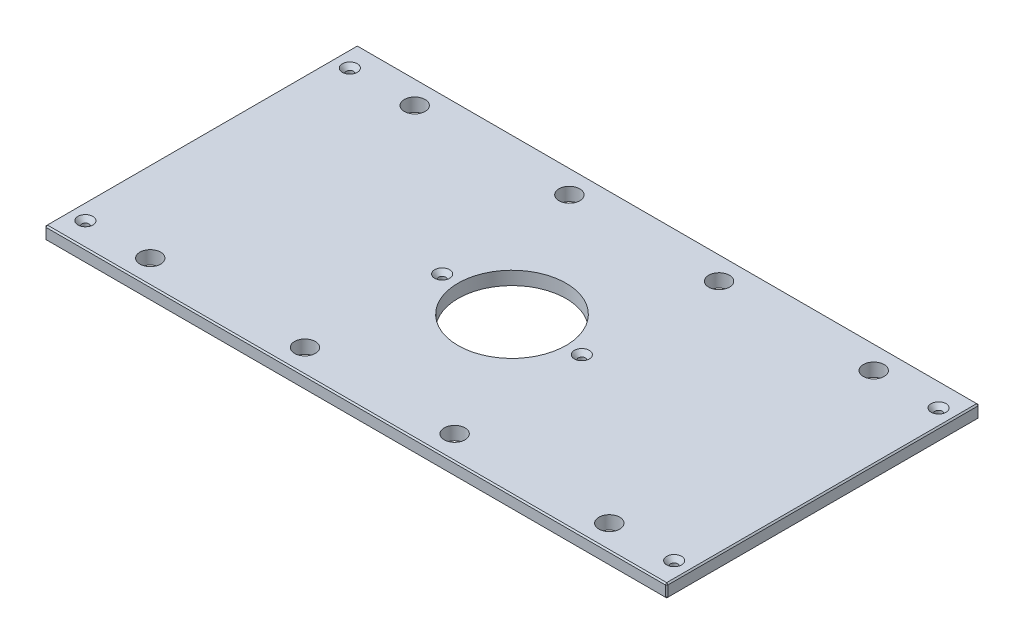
ISO-10303-21;
HEADER;
FILE_DESCRIPTION(('STEP AP214'),'2;1');
FILE_NAME('part.step','',(''),(''),'','','');
FILE_SCHEMA(('AUTOMOTIVE_DESIGN { 1 0 10303 214 1 1 1 1 }'));
ENDSEC;
DATA;
#1=APPLICATION_CONTEXT('core data for automotive mechanical design processes');
#2=APPLICATION_PROTOCOL_DEFINITION('international standard','automotive_design',2000,#1);
#3=PRODUCT_CONTEXT('',#1,'mechanical');
#4=PRODUCT('Part','Part','',(#3));
#5=PRODUCT_RELATED_PRODUCT_CATEGORY('part','',(#4));
#6=PRODUCT_DEFINITION_FORMATION('','',#4);
#7=PRODUCT_DEFINITION_CONTEXT('part definition',#1,'design');
#8=PRODUCT_DEFINITION('design','',#6,#7);
#9=PRODUCT_DEFINITION_SHAPE('','',#8);
#10=(LENGTH_UNIT() NAMED_UNIT(*) SI_UNIT(.MILLI.,.METRE.));
#11=(NAMED_UNIT(*) PLANE_ANGLE_UNIT() SI_UNIT($,.RADIAN.));
#12=(NAMED_UNIT(*) SI_UNIT($,.STERADIAN.) SOLID_ANGLE_UNIT());
#13=UNCERTAINTY_MEASURE_WITH_UNIT(LENGTH_MEASURE(1.E-05),#10,'distance_accuracy_value','');
#14=(GEOMETRIC_REPRESENTATION_CONTEXT(3) GLOBAL_UNCERTAINTY_ASSIGNED_CONTEXT((#13)) GLOBAL_UNIT_ASSIGNED_CONTEXT((#10,
#11,#12)) REPRESENTATION_CONTEXT('',''));
#15=CARTESIAN_POINT('',(0.,0.,0.));
#16=DIRECTION('',(0.,0.,1.));
#17=DIRECTION('',(1.,0.,0.));
#18=AXIS2_PLACEMENT_3D('',#15,#16,#17);
#19=CARTESIAN_POINT('',(-296.8625,12.7,-149.225));
#20=DIRECTION('',(1.,0.,0.));
#21=DIRECTION('',(0.,0.,-1.));
#22=AXIS2_PLACEMENT_3D('',#19,#20,#21);
#23=PLANE('',#22);
#24=DIRECTION('',(0.,0.,-1.));
#25=VECTOR('',#24,1.);
#26=CARTESIAN_POINT('',(-296.8625,11.43,-149.225));
#27=LINE('',#26,#25);
#28=CARTESIAN_POINT('',(-296.8625,11.43,147.955));
#29=VERTEX_POINT('',#28);
#30=CARTESIAN_POINT('',(-296.8625,11.43,-147.955));
#31=VERTEX_POINT('',#30);
#32=EDGE_CURVE('E135',#29,#31,#27,.T.);
#33=ORIENTED_EDGE('',*,*,#32,.T.);
#34=DIRECTION('',(0.,-1.,0.));
#35=VECTOR('',#34,1.);
#36=CARTESIAN_POINT('',(-296.8625,12.7,-147.955));
#37=LINE('',#36,#35);
#38=CARTESIAN_POINT('',(-296.8625,1.26999999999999,-147.955));
#39=VERTEX_POINT('',#38);
#40=EDGE_CURVE('E131',#31,#39,#37,.T.);
#41=ORIENTED_EDGE('',*,*,#40,.T.);
#42=DIRECTION('',(0.,0.,1.));
#43=VECTOR('',#42,1.);
#44=CARTESIAN_POINT('',(-296.8625,1.26999999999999,-149.225));
#45=LINE('',#44,#43);
#46=CARTESIAN_POINT('',(-296.8625,1.26999999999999,147.955));
#47=VERTEX_POINT('',#46);
#48=EDGE_CURVE('E126',#39,#47,#45,.T.);
#49=ORIENTED_EDGE('',*,*,#48,.T.);
#50=DIRECTION('',(0.,1.,0.));
#51=VECTOR('',#50,1.);
#52=CARTESIAN_POINT('',(-296.8625,12.7,147.955));
#53=LINE('',#52,#51);
#54=EDGE_CURVE('E128',#47,#29,#53,.T.);
#55=ORIENTED_EDGE('',*,*,#54,.T.);
#56=EDGE_LOOP('',(#33,#41,#49,#55));
#57=FACE_BOUND('',#56,.T.);
#58=ADVANCED_FACE('F35',(#57),#23,.F.);
#59=CARTESIAN_POINT('',(-296.8625,12.7,149.225));
#60=DIRECTION('',(0.,0.,-1.));
#61=DIRECTION('',(-1.,0.,0.));
#62=AXIS2_PLACEMENT_3D('',#59,#60,#61);
#63=PLANE('',#62);
#64=DIRECTION('',(1.,0.,0.));
#65=VECTOR('',#64,1.);
#66=CARTESIAN_POINT('',(-296.8625,1.27000000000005,149.225));
#67=LINE('',#66,#65);
#68=CARTESIAN_POINT('',(-295.5925,1.27000000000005,149.225));
#69=VERTEX_POINT('',#68);
#70=CARTESIAN_POINT('',(295.5925,1.27000000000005,149.225));
#71=VERTEX_POINT('',#70);
#72=EDGE_CURVE('E58',#69,#71,#67,.T.);
#73=ORIENTED_EDGE('',*,*,#72,.T.);
#74=DIRECTION('',(0.,1.,0.));
#75=VECTOR('',#74,1.);
#76=CARTESIAN_POINT('',(295.5925,12.7,149.225));
#77=LINE('',#76,#75);
#78=CARTESIAN_POINT('',(295.5925,11.4299999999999,149.225));
#79=VERTEX_POINT('',#78);
#80=EDGE_CURVE('E11',#71,#79,#77,.T.);
#81=ORIENTED_EDGE('',*,*,#80,.T.);
#82=DIRECTION('',(-1.,0.,0.));
#83=VECTOR('',#82,1.);
#84=CARTESIAN_POINT('',(-296.8625,11.4299999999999,149.225));
#85=LINE('',#84,#83);
#86=CARTESIAN_POINT('',(-295.5925,11.4299999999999,149.225));
#87=VERTEX_POINT('',#86);
#88=EDGE_CURVE('E44',#79,#87,#85,.T.);
#89=ORIENTED_EDGE('',*,*,#88,.T.);
#90=DIRECTION('',(0.,-1.,0.));
#91=VECTOR('',#90,1.);
#92=CARTESIAN_POINT('',(-295.5925,12.7,149.225));
#93=LINE('',#92,#91);
#94=EDGE_CURVE('E303',#87,#69,#93,.T.);
#95=ORIENTED_EDGE('',*,*,#94,.T.);
#96=EDGE_LOOP('',(#73,#81,#89,#95));
#97=FACE_BOUND('',#96,.T.);
#98=ADVANCED_FACE('F372',(#97),#63,.F.);
#99=CARTESIAN_POINT('',(296.8625,12.7,-149.225));
#100=DIRECTION('',(-1.,0.,0.));
#101=DIRECTION('',(0.,0.,1.));
#102=AXIS2_PLACEMENT_3D('',#99,#100,#101);
#103=PLANE('',#102);
#104=DIRECTION('',(0.,0.,-1.));
#105=VECTOR('',#104,1.);
#106=CARTESIAN_POINT('',(296.8625,1.27000000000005,-149.225));
#107=LINE('',#106,#105);
#108=CARTESIAN_POINT('',(296.8625,1.27000000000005,147.955));
#109=VERTEX_POINT('',#108);
#110=CARTESIAN_POINT('',(296.8625,1.27000000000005,-147.955));
#111=VERTEX_POINT('',#110);
#112=EDGE_CURVE('E298',#109,#111,#107,.T.);
#113=ORIENTED_EDGE('',*,*,#112,.T.);
#114=DIRECTION('',(0.,1.,0.));
#115=VECTOR('',#114,1.);
#116=CARTESIAN_POINT('',(296.8625,12.7,-147.955));
#117=LINE('',#116,#115);
#118=CARTESIAN_POINT('',(296.8625,11.43,-147.955));
#119=VERTEX_POINT('',#118);
#120=EDGE_CURVE('E300',#111,#119,#117,.T.);
#121=ORIENTED_EDGE('',*,*,#120,.T.);
#122=DIRECTION('',(0.,0.,1.));
#123=VECTOR('',#122,1.);
#124=CARTESIAN_POINT('',(296.8625,11.43,149.225));
#125=LINE('',#124,#123);
#126=CARTESIAN_POINT('',(296.8625,11.43,147.955));
#127=VERTEX_POINT('',#126);
#128=EDGE_CURVE('E296',#119,#127,#125,.T.);
#129=ORIENTED_EDGE('',*,*,#128,.T.);
#130=DIRECTION('',(0.,-1.,0.));
#131=VECTOR('',#130,1.);
#132=CARTESIAN_POINT('',(296.8625,12.7,147.955));
#133=LINE('',#132,#131);
#134=EDGE_CURVE('E294',#127,#109,#133,.T.);
#135=ORIENTED_EDGE('',*,*,#134,.T.);
#136=EDGE_LOOP('',(#113,#121,#129,#135));
#137=FACE_BOUND('',#136,.T.);
#138=ADVANCED_FACE('F359',(#137),#103,.F.);
#139=CARTESIAN_POINT('',(-296.8625,12.7,-149.225));
#140=DIRECTION('',(0.,0.,1.));
#141=DIRECTION('',(1.,0.,0.));
#142=AXIS2_PLACEMENT_3D('',#139,#140,#141);
#143=PLANE('',#142);
#144=DIRECTION('',(-1.,0.,0.));
#145=VECTOR('',#144,1.);
#146=CARTESIAN_POINT('',(-296.8625,1.27000000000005,-149.225));
#147=LINE('',#146,#145);
#148=CARTESIAN_POINT('',(295.5925,1.27000000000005,-149.225));
#149=VERTEX_POINT('',#148);
#150=CARTESIAN_POINT('',(-295.5925,1.27000000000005,-149.225));
#151=VERTEX_POINT('',#150);
#152=EDGE_CURVE('E270',#149,#151,#147,.T.);
#153=ORIENTED_EDGE('',*,*,#152,.T.);
#154=DIRECTION('',(0.,1.,0.));
#155=VECTOR('',#154,1.);
#156=CARTESIAN_POINT('',(-295.5925,12.7,-149.225));
#157=LINE('',#156,#155);
#158=CARTESIAN_POINT('',(-295.5925,11.43,-149.225));
#159=VERTEX_POINT('',#158);
#160=EDGE_CURVE('E274',#151,#159,#157,.T.);
#161=ORIENTED_EDGE('',*,*,#160,.T.);
#162=DIRECTION('',(1.,0.,0.));
#163=VECTOR('',#162,1.);
#164=CARTESIAN_POINT('',(296.8625,11.43,-149.225));
#165=LINE('',#164,#163);
#166=CARTESIAN_POINT('',(295.5925,11.43,-149.225));
#167=VERTEX_POINT('',#166);
#168=EDGE_CURVE('E272',#159,#167,#165,.T.);
#169=ORIENTED_EDGE('',*,*,#168,.T.);
#170=DIRECTION('',(0.,-1.,0.));
#171=VECTOR('',#170,1.);
#172=CARTESIAN_POINT('',(295.5925,12.7,-149.225));
#173=LINE('',#172,#171);
#174=EDGE_CURVE('E268',#167,#149,#173,.T.);
#175=ORIENTED_EDGE('',*,*,#174,.T.);
#176=EDGE_LOOP('',(#153,#161,#169,#175));
#177=FACE_BOUND('',#176,.T.);
#178=ADVANCED_FACE('F333',(#177),#143,.F.);
#179=CARTESIAN_POINT('',(0.,12.7,0.));
#180=DIRECTION('',(0.,1.,0.));
#181=DIRECTION('',(0.,0.,1.));
#182=AXIS2_PLACEMENT_3D('',#179,#180,#181);
#183=PLANE('',#182);
#184=CARTESIAN_POINT('',(280.9875,12.7,-126.20498));
#185=DIRECTION('',(0.,1.,0.));
#186=DIRECTION('',(0.,0.,1.));
#187=AXIS2_PLACEMENT_3D('',#184,#185,#186);
#188=CIRCLE('',#187,7.13740000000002);
#189=CARTESIAN_POINT('',(280.9875,12.7,-119.06758));
#190=VERTEX_POINT('',#189);
#191=EDGE_CURVE('E816',#190,#190,#188,.T.);
#192=ORIENTED_EDGE('',*,*,#191,.F.);
#193=EDGE_LOOP('',(#192));
#194=FACE_BOUND('',#193,.T.);
#195=CARTESIAN_POINT('',(280.9875,12.7,126.20498));
#196=DIRECTION('',(0.,1.,0.));
#197=DIRECTION('',(0.,0.,1.));
#198=AXIS2_PLACEMENT_3D('',#195,#196,#197);
#199=CIRCLE('',#198,7.13740000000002);
#200=CARTESIAN_POINT('',(280.9875,12.7,133.34238));
#201=VERTEX_POINT('',#200);
#202=EDGE_CURVE('E820',#201,#201,#199,.T.);
#203=ORIENTED_EDGE('',*,*,#202,.F.);
#204=EDGE_LOOP('',(#203));
#205=FACE_BOUND('',#204,.T.);
#206=CARTESIAN_POINT('',(-280.9875,12.7,126.20498));
#207=DIRECTION('',(0.,1.,0.));
#208=DIRECTION('',(0.,0.,1.));
#209=AXIS2_PLACEMENT_3D('',#206,#207,#208);
#210=CIRCLE('',#209,7.13740000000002);
#211=CARTESIAN_POINT('',(-280.9875,12.7,133.34238));
#212=VERTEX_POINT('',#211);
#213=EDGE_CURVE('E824',#212,#212,#210,.T.);
#214=ORIENTED_EDGE('',*,*,#213,.F.);
#215=EDGE_LOOP('',(#214));
#216=FACE_BOUND('',#215,.T.);
#217=CARTESIAN_POINT('',(-66.675,12.7,0.));
#218=DIRECTION('',(0.,1.,0.));
#219=DIRECTION('',(0.,0.,1.));
#220=AXIS2_PLACEMENT_3D('',#217,#218,#219);
#221=CIRCLE('',#220,7.1374);
#222=CARTESIAN_POINT('',(-66.675,12.7,7.1374));
#223=VERTEX_POINT('',#222);
#224=EDGE_CURVE('E828',#223,#223,#221,.T.);
#225=ORIENTED_EDGE('',*,*,#224,.F.);
#226=EDGE_LOOP('',(#225));
#227=FACE_BOUND('',#226,.T.);
#228=CARTESIAN_POINT('',(66.675,12.7,0.));
#229=DIRECTION('',(0.,1.,0.));
#230=DIRECTION('',(0.,0.,1.));
#231=AXIS2_PLACEMENT_3D('',#228,#229,#230);
#232=CIRCLE('',#231,7.1374);
#233=CARTESIAN_POINT('',(66.675,12.7,7.1374));
#234=VERTEX_POINT('',#233);
#235=EDGE_CURVE('E832',#234,#234,#232,.T.);
#236=ORIENTED_EDGE('',*,*,#235,.F.);
#237=EDGE_LOOP('',(#236));
#238=FACE_BOUND('',#237,.T.);
#239=CARTESIAN_POINT('',(-280.9875,12.7,-126.20498));
#240=DIRECTION('',(0.,1.,0.));
#241=DIRECTION('',(0.,0.,1.));
#242=AXIS2_PLACEMENT_3D('',#239,#240,#241);
#243=CIRCLE('',#242,7.13740000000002);
#244=CARTESIAN_POINT('',(-280.9875,12.7,-119.06758));
#245=VERTEX_POINT('',#244);
#246=EDGE_CURVE('E835',#245,#245,#243,.T.);
#247=ORIENTED_EDGE('',*,*,#246,.F.);
#248=EDGE_LOOP('',(#247));
#249=FACE_BOUND('',#248,.T.);
#250=DIRECTION('',(0.,0.,-1.));
#251=VECTOR('',#250,1.);
#252=CARTESIAN_POINT('',(295.5925,12.7,-149.225));
#253=LINE('',#252,#251);
#254=CARTESIAN_POINT('',(295.5925,12.7,147.955));
#255=VERTEX_POINT('',#254);
#256=CARTESIAN_POINT('',(295.5925,12.7,-147.955));
#257=VERTEX_POINT('',#256);
#258=EDGE_CURVE('E281',#255,#257,#253,.T.);
#259=ORIENTED_EDGE('',*,*,#258,.T.);
#260=DIRECTION('',(-1.,0.,0.));
#261=VECTOR('',#260,1.);
#262=CARTESIAN_POINT('',(-296.8625,12.7,-147.955));
#263=LINE('',#262,#261);
#264=CARTESIAN_POINT('',(-295.5925,12.7,-147.955));
#265=VERTEX_POINT('',#264);
#266=EDGE_CURVE('E283',#257,#265,#263,.T.);
#267=ORIENTED_EDGE('',*,*,#266,.T.);
#268=DIRECTION('',(0.,0.,1.));
#269=VECTOR('',#268,1.);
#270=CARTESIAN_POINT('',(-295.5925,12.7,149.225));
#271=LINE('',#270,#269);
#272=CARTESIAN_POINT('',(-295.5925,12.7,147.955));
#273=VERTEX_POINT('',#272);
#274=EDGE_CURVE('E279',#265,#273,#271,.T.);
#275=ORIENTED_EDGE('',*,*,#274,.T.);
#276=DIRECTION('',(1.,0.,0.));
#277=VECTOR('',#276,1.);
#278=CARTESIAN_POINT('',(296.8625,12.7,147.955));
#279=LINE('',#278,#277);
#280=EDGE_CURVE('E277',#273,#255,#279,.T.);
#281=ORIENTED_EDGE('',*,*,#280,.T.);
#282=EDGE_LOOP('',(#259,#267,#275,#281));
#283=FACE_BOUND('',#282,.T.);
#284=CARTESIAN_POINT('',(219.075,12.7,-126.20498));
#285=DIRECTION('',(0.,1.,0.));
#286=DIRECTION('',(0.,0.,1.));
#287=AXIS2_PLACEMENT_3D('',#284,#285,#286);
#288=CIRCLE('',#287,9.921875);
#289=CARTESIAN_POINT('',(219.075,12.7,-116.283105));
#290=VERTEX_POINT('',#289);
#291=EDGE_CURVE('E204',#290,#290,#288,.T.);
#292=ORIENTED_EDGE('',*,*,#291,.F.);
#293=EDGE_LOOP('',(#292));
#294=FACE_BOUND('',#293,.T.);
#295=CARTESIAN_POINT('',(-219.075,12.7,-126.20498));
#296=DIRECTION('',(0.,1.,0.));
#297=DIRECTION('',(0.,0.,1.));
#298=AXIS2_PLACEMENT_3D('',#295,#296,#297);
#299=CIRCLE('',#298,9.921875);
#300=CARTESIAN_POINT('',(-219.075,12.7,-116.283105));
#301=VERTEX_POINT('',#300);
#302=EDGE_CURVE('E214',#301,#301,#299,.T.);
#303=ORIENTED_EDGE('',*,*,#302,.F.);
#304=EDGE_LOOP('',(#303));
#305=FACE_BOUND('',#304,.T.);
#306=CARTESIAN_POINT('',(219.075,12.7,126.20498));
#307=DIRECTION('',(0.,1.,0.));
#308=DIRECTION('',(0.,0.,1.));
#309=AXIS2_PLACEMENT_3D('',#306,#307,#308);
#310=CIRCLE('',#309,9.921875);
#311=CARTESIAN_POINT('',(219.075,12.7,136.126855));
#312=VERTEX_POINT('',#311);
#313=EDGE_CURVE('E225',#312,#312,#310,.T.);
#314=ORIENTED_EDGE('',*,*,#313,.F.);
#315=EDGE_LOOP('',(#314));
#316=FACE_BOUND('',#315,.T.);
#317=CARTESIAN_POINT('',(-219.075,12.7,126.20498));
#318=DIRECTION('',(0.,1.,0.));
#319=DIRECTION('',(0.,0.,1.));
#320=AXIS2_PLACEMENT_3D('',#317,#318,#319);
#321=CIRCLE('',#320,9.921875);
#322=CARTESIAN_POINT('',(-219.075,12.7,136.126855));
#323=VERTEX_POINT('',#322);
#324=EDGE_CURVE('E231',#323,#323,#321,.T.);
#325=ORIENTED_EDGE('',*,*,#324,.F.);
#326=EDGE_LOOP('',(#325));
#327=FACE_BOUND('',#326,.T.);
#328=CARTESIAN_POINT('',(-71.4375,12.7,-126.20498));
#329=DIRECTION('',(0.,1.,0.));
#330=DIRECTION('',(0.,0.,1.));
#331=AXIS2_PLACEMENT_3D('',#328,#329,#330);
#332=CIRCLE('',#331,9.921875);
#333=CARTESIAN_POINT('',(-71.4375,12.7,-116.283105));
#334=VERTEX_POINT('',#333);
#335=EDGE_CURVE('E237',#334,#334,#332,.T.);
#336=ORIENTED_EDGE('',*,*,#335,.F.);
#337=EDGE_LOOP('',(#336));
#338=FACE_BOUND('',#337,.T.);
#339=CARTESIAN_POINT('',(71.4375,12.7,-126.20498));
#340=DIRECTION('',(0.,1.,0.));
#341=DIRECTION('',(0.,0.,1.));
#342=AXIS2_PLACEMENT_3D('',#339,#340,#341);
#343=CIRCLE('',#342,9.921875);
#344=CARTESIAN_POINT('',(71.4375,12.7,-116.283105));
#345=VERTEX_POINT('',#344);
#346=EDGE_CURVE('E243',#345,#345,#343,.T.);
#347=ORIENTED_EDGE('',*,*,#346,.F.);
#348=EDGE_LOOP('',(#347));
#349=FACE_BOUND('',#348,.T.);
#350=CARTESIAN_POINT('',(71.4375,12.7,126.20498));
#351=DIRECTION('',(0.,1.,0.));
#352=DIRECTION('',(0.,0.,1.));
#353=AXIS2_PLACEMENT_3D('',#350,#351,#352);
#354=CIRCLE('',#353,9.921875);
#355=CARTESIAN_POINT('',(71.4375,12.7,136.126855));
#356=VERTEX_POINT('',#355);
#357=EDGE_CURVE('E249',#356,#356,#354,.T.);
#358=ORIENTED_EDGE('',*,*,#357,.F.);
#359=EDGE_LOOP('',(#358));
#360=FACE_BOUND('',#359,.T.);
#361=CARTESIAN_POINT('',(-71.4375,12.7,126.20498));
#362=DIRECTION('',(0.,1.,0.));
#363=DIRECTION('',(0.,0.,1.));
#364=AXIS2_PLACEMENT_3D('',#361,#362,#363);
#365=CIRCLE('',#364,9.921875);
#366=CARTESIAN_POINT('',(-71.4375,12.7,136.126855));
#367=VERTEX_POINT('',#366);
#368=EDGE_CURVE('E255',#367,#367,#365,.T.);
#369=ORIENTED_EDGE('',*,*,#368,.F.);
#370=EDGE_LOOP('',(#369));
#371=FACE_BOUND('',#370,.T.);
#372=CARTESIAN_POINT('',(0.,12.7,0.));
#373=DIRECTION('',(0.,1.,0.));
#374=DIRECTION('',(0.,0.,1.));
#375=AXIS2_PLACEMENT_3D('',#372,#373,#374);
#376=CIRCLE('',#375,51.562);
#377=CARTESIAN_POINT('',(0.,12.7,51.562));
#378=VERTEX_POINT('',#377);
#379=EDGE_CURVE('E261',#378,#378,#376,.T.);
#380=ORIENTED_EDGE('',*,*,#379,.F.);
#381=EDGE_LOOP('',(#380));
#382=FACE_BOUND('',#381,.T.);
#383=ADVANCED_FACE('F381',(#194,#205,#216,#227,#238,#249,#283,#294,#305,#316,#327,#338,#349,
#360,#371,#382),#183,.T.);
#384=CARTESIAN_POINT('',(0.,0.,0.));
#385=DIRECTION('',(0.,1.,0.));
#386=DIRECTION('',(0.,0.,1.));
#387=AXIS2_PLACEMENT_3D('',#384,#385,#386);
#388=PLANE('',#387);
#389=CARTESIAN_POINT('',(280.9875,0.,-126.20498));
#390=DIRECTION('',(0.,1.,0.));
#391=DIRECTION('',(0.,0.,1.));
#392=AXIS2_PLACEMENT_3D('',#389,#390,#391);
#393=CIRCLE('',#392,3.3782);
#394=CARTESIAN_POINT('',(280.9875,0.,-122.82678));
#395=VERTEX_POINT('',#394);
#396=EDGE_CURVE('E869',#395,#395,#393,.T.);
#397=ORIENTED_EDGE('',*,*,#396,.T.);
#398=EDGE_LOOP('',(#397));
#399=FACE_BOUND('',#398,.T.);
#400=CARTESIAN_POINT('',(280.9875,0.,126.20498));
#401=DIRECTION('',(0.,1.,0.));
#402=DIRECTION('',(0.,0.,1.));
#403=AXIS2_PLACEMENT_3D('',#400,#401,#402);
#404=CIRCLE('',#403,3.3782);
#405=CARTESIAN_POINT('',(280.9875,0.,129.58318));
#406=VERTEX_POINT('',#405);
#407=EDGE_CURVE('E862',#406,#406,#404,.T.);
#408=ORIENTED_EDGE('',*,*,#407,.T.);
#409=EDGE_LOOP('',(#408));
#410=FACE_BOUND('',#409,.T.);
#411=CARTESIAN_POINT('',(-280.9875,0.,126.20498));
#412=DIRECTION('',(0.,1.,0.));
#413=DIRECTION('',(0.,0.,1.));
#414=AXIS2_PLACEMENT_3D('',#411,#412,#413);
#415=CIRCLE('',#414,3.3782);
#416=CARTESIAN_POINT('',(-280.9875,0.,129.58318));
#417=VERTEX_POINT('',#416);
#418=EDGE_CURVE('E855',#417,#417,#415,.T.);
#419=ORIENTED_EDGE('',*,*,#418,.T.);
#420=EDGE_LOOP('',(#419));
#421=FACE_BOUND('',#420,.T.);
#422=CARTESIAN_POINT('',(-66.675,0.,0.));
#423=DIRECTION('',(0.,1.,0.));
#424=DIRECTION('',(0.,0.,1.));
#425=AXIS2_PLACEMENT_3D('',#422,#423,#424);
#426=CIRCLE('',#425,3.3782);
#427=CARTESIAN_POINT('',(-66.675,0.,3.3782));
#428=VERTEX_POINT('',#427);
#429=EDGE_CURVE('E848',#428,#428,#426,.T.);
#430=ORIENTED_EDGE('',*,*,#429,.T.);
#431=EDGE_LOOP('',(#430));
#432=FACE_BOUND('',#431,.T.);
#433=CARTESIAN_POINT('',(66.675,0.,0.));
#434=DIRECTION('',(0.,1.,0.));
#435=DIRECTION('',(0.,0.,1.));
#436=AXIS2_PLACEMENT_3D('',#433,#434,#435);
#437=CIRCLE('',#436,3.3782);
#438=CARTESIAN_POINT('',(66.675,0.,3.3782));
#439=VERTEX_POINT('',#438);
#440=EDGE_CURVE('E838',#439,#439,#437,.T.);
#441=ORIENTED_EDGE('',*,*,#440,.T.);
#442=EDGE_LOOP('',(#441));
#443=FACE_BOUND('',#442,.T.);
#444=CARTESIAN_POINT('',(-280.9875,0.,-126.20498));
#445=DIRECTION('',(0.,1.,0.));
#446=DIRECTION('',(0.,0.,1.));
#447=AXIS2_PLACEMENT_3D('',#444,#445,#446);
#448=CIRCLE('',#447,3.3782);
#449=CARTESIAN_POINT('',(-280.9875,0.,-122.82678));
#450=VERTEX_POINT('',#449);
#451=EDGE_CURVE('E217',#450,#450,#448,.T.);
#452=ORIENTED_EDGE('',*,*,#451,.T.);
#453=EDGE_LOOP('',(#452));
#454=FACE_BOUND('',#453,.T.);
#455=DIRECTION('',(0.,0.,-1.));
#456=VECTOR('',#455,1.);
#457=CARTESIAN_POINT('',(-295.5925,0.,0.));
#458=LINE('',#457,#456);
#459=CARTESIAN_POINT('',(-295.5925,0.,147.955));
#460=VERTEX_POINT('',#459);
#461=CARTESIAN_POINT('',(-295.5925,0.,-147.955));
#462=VERTEX_POINT('',#461);
#463=EDGE_CURVE('E158',#460,#462,#458,.T.);
#464=ORIENTED_EDGE('',*,*,#463,.T.);
#465=DIRECTION('',(1.,0.,0.));
#466=VECTOR('',#465,1.);
#467=CARTESIAN_POINT('',(0.,0.,-147.955));
#468=LINE('',#467,#466);
#469=CARTESIAN_POINT('',(295.5925,0.,-147.955));
#470=VERTEX_POINT('',#469);
#471=EDGE_CURVE('E291',#462,#470,#468,.T.);
#472=ORIENTED_EDGE('',*,*,#471,.T.);
#473=DIRECTION('',(0.,0.,1.));
#474=VECTOR('',#473,1.);
#475=CARTESIAN_POINT('',(295.5925,0.,0.));
#476=LINE('',#475,#474);
#477=CARTESIAN_POINT('',(295.5925,0.,147.955));
#478=VERTEX_POINT('',#477);
#479=EDGE_CURVE('E289',#470,#478,#476,.T.);
#480=ORIENTED_EDGE('',*,*,#479,.T.);
#481=DIRECTION('',(-1.,0.,0.));
#482=VECTOR('',#481,1.);
#483=CARTESIAN_POINT('',(0.,0.,147.955));
#484=LINE('',#483,#482);
#485=EDGE_CURVE('E286',#478,#460,#484,.T.);
#486=ORIENTED_EDGE('',*,*,#485,.T.);
#487=EDGE_LOOP('',(#464,#472,#480,#486));
#488=FACE_BOUND('',#487,.T.);
#489=CARTESIAN_POINT('',(219.075,0.,-126.20498));
#490=DIRECTION('',(0.,1.,0.));
#491=DIRECTION('',(0.,0.,1.));
#492=AXIS2_PLACEMENT_3D('',#489,#490,#491);
#493=CIRCLE('',#492,9.921875);
#494=CARTESIAN_POINT('',(219.075,0.,-116.283105));
#495=VERTEX_POINT('',#494);
#496=EDGE_CURVE('E209',#495,#495,#493,.T.);
#497=ORIENTED_EDGE('',*,*,#496,.T.);
#498=EDGE_LOOP('',(#497));
#499=FACE_BOUND('',#498,.T.);
#500=CARTESIAN_POINT('',(-219.075,0.,-126.20498));
#501=DIRECTION('',(0.,1.,0.));
#502=DIRECTION('',(0.,0.,1.));
#503=AXIS2_PLACEMENT_3D('',#500,#501,#502);
#504=CIRCLE('',#503,9.921875);
#505=CARTESIAN_POINT('',(-219.075,0.,-116.283105));
#506=VERTEX_POINT('',#505);
#507=EDGE_CURVE('E222',#506,#506,#504,.T.);
#508=ORIENTED_EDGE('',*,*,#507,.T.);
#509=EDGE_LOOP('',(#508));
#510=FACE_BOUND('',#509,.T.);
#511=CARTESIAN_POINT('',(219.075,0.,126.20498));
#512=DIRECTION('',(0.,1.,0.));
#513=DIRECTION('',(0.,0.,1.));
#514=AXIS2_PLACEMENT_3D('',#511,#512,#513);
#515=CIRCLE('',#514,9.921875);
#516=CARTESIAN_POINT('',(219.075,0.,136.126855));
#517=VERTEX_POINT('',#516);
#518=EDGE_CURVE('E228',#517,#517,#515,.T.);
#519=ORIENTED_EDGE('',*,*,#518,.T.);
#520=EDGE_LOOP('',(#519));
#521=FACE_BOUND('',#520,.T.);
#522=CARTESIAN_POINT('',(-219.075,0.,126.20498));
#523=DIRECTION('',(0.,1.,0.));
#524=DIRECTION('',(0.,0.,1.));
#525=AXIS2_PLACEMENT_3D('',#522,#523,#524);
#526=CIRCLE('',#525,9.921875);
#527=CARTESIAN_POINT('',(-219.075,0.,136.126855));
#528=VERTEX_POINT('',#527);
#529=EDGE_CURVE('E234',#528,#528,#526,.T.);
#530=ORIENTED_EDGE('',*,*,#529,.T.);
#531=EDGE_LOOP('',(#530));
#532=FACE_BOUND('',#531,.T.);
#533=CARTESIAN_POINT('',(-71.4375,0.,-126.20498));
#534=DIRECTION('',(0.,1.,0.));
#535=DIRECTION('',(0.,0.,1.));
#536=AXIS2_PLACEMENT_3D('',#533,#534,#535);
#537=CIRCLE('',#536,9.921875);
#538=CARTESIAN_POINT('',(-71.4375,0.,-116.283105));
#539=VERTEX_POINT('',#538);
#540=EDGE_CURVE('E240',#539,#539,#537,.T.);
#541=ORIENTED_EDGE('',*,*,#540,.T.);
#542=EDGE_LOOP('',(#541));
#543=FACE_BOUND('',#542,.T.);
#544=CARTESIAN_POINT('',(71.4375,0.,-126.20498));
#545=DIRECTION('',(0.,1.,0.));
#546=DIRECTION('',(0.,0.,1.));
#547=AXIS2_PLACEMENT_3D('',#544,#545,#546);
#548=CIRCLE('',#547,9.921875);
#549=CARTESIAN_POINT('',(71.4375,0.,-116.283105));
#550=VERTEX_POINT('',#549);
#551=EDGE_CURVE('E246',#550,#550,#548,.T.);
#552=ORIENTED_EDGE('',*,*,#551,.T.);
#553=EDGE_LOOP('',(#552));
#554=FACE_BOUND('',#553,.T.);
#555=CARTESIAN_POINT('',(71.4375,0.,126.20498));
#556=DIRECTION('',(0.,1.,0.));
#557=DIRECTION('',(0.,0.,1.));
#558=AXIS2_PLACEMENT_3D('',#555,#556,#557);
#559=CIRCLE('',#558,9.921875);
#560=CARTESIAN_POINT('',(71.4375,0.,136.126855));
#561=VERTEX_POINT('',#560);
#562=EDGE_CURVE('E252',#561,#561,#559,.T.);
#563=ORIENTED_EDGE('',*,*,#562,.T.);
#564=EDGE_LOOP('',(#563));
#565=FACE_BOUND('',#564,.T.);
#566=CARTESIAN_POINT('',(-71.4375,0.,126.20498));
#567=DIRECTION('',(0.,1.,0.));
#568=DIRECTION('',(0.,0.,1.));
#569=AXIS2_PLACEMENT_3D('',#566,#567,#568);
#570=CIRCLE('',#569,9.921875);
#571=CARTESIAN_POINT('',(-71.4375,0.,136.126855));
#572=VERTEX_POINT('',#571);
#573=EDGE_CURVE('E258',#572,#572,#570,.T.);
#574=ORIENTED_EDGE('',*,*,#573,.T.);
#575=EDGE_LOOP('',(#574));
#576=FACE_BOUND('',#575,.T.);
#577=CARTESIAN_POINT('',(0.,0.,0.));
#578=DIRECTION('',(0.,1.,0.));
#579=DIRECTION('',(0.,0.,1.));
#580=AXIS2_PLACEMENT_3D('',#577,#578,#579);
#581=CIRCLE('',#580,51.562);
#582=CARTESIAN_POINT('',(0.,0.,51.562));
#583=VERTEX_POINT('',#582);
#584=EDGE_CURVE('E147',#583,#583,#581,.T.);
#585=ORIENTED_EDGE('',*,*,#584,.T.);
#586=EDGE_LOOP('',(#585));
#587=FACE_BOUND('',#586,.T.);
#588=ADVANCED_FACE('F346',(#399,#410,#421,#432,#443,#454,#488,#499,#510,#521,#532,#543,#554,
#565,#576,#587),#388,.F.);
#589=CARTESIAN_POINT('',(0.,0.,0.));
#590=DIRECTION('',(0.,1.,0.));
#591=DIRECTION('',(0.,0.,1.));
#592=AXIS2_PLACEMENT_3D('',#589,#590,#591);
#593=CYLINDRICAL_SURFACE('',#592,51.562);
#594=ORIENTED_EDGE('',*,*,#584,.F.);
#595=EDGE_LOOP('',(#594));
#596=FACE_BOUND('',#595,.T.);
#597=ORIENTED_EDGE('',*,*,#379,.T.);
#598=EDGE_LOOP('',(#597));
#599=FACE_BOUND('',#598,.T.);
#600=ADVANCED_FACE('F751',(#596,#599),#593,.F.);
#601=CARTESIAN_POINT('',(-71.4375,12.7,126.20498));
#602=DIRECTION('',(0.,1.,0.));
#603=DIRECTION('',(0.,0.,1.));
#604=AXIS2_PLACEMENT_3D('',#601,#602,#603);
#605=CYLINDRICAL_SURFACE('',#604,9.921875);
#606=ORIENTED_EDGE('',*,*,#573,.F.);
#607=EDGE_LOOP('',(#606));
#608=FACE_BOUND('',#607,.T.);
#609=ORIENTED_EDGE('',*,*,#368,.T.);
#610=EDGE_LOOP('',(#609));
#611=FACE_BOUND('',#610,.T.);
#612=ADVANCED_FACE('F742',(#608,#611),#605,.F.);
#613=CARTESIAN_POINT('',(71.4375,12.7,126.20498));
#614=DIRECTION('',(0.,1.,0.));
#615=DIRECTION('',(0.,0.,1.));
#616=AXIS2_PLACEMENT_3D('',#613,#614,#615);
#617=CYLINDRICAL_SURFACE('',#616,9.921875);
#618=ORIENTED_EDGE('',*,*,#562,.F.);
#619=EDGE_LOOP('',(#618));
#620=FACE_BOUND('',#619,.T.);
#621=ORIENTED_EDGE('',*,*,#357,.T.);
#622=EDGE_LOOP('',(#621));
#623=FACE_BOUND('',#622,.T.);
#624=ADVANCED_FACE('F733',(#620,#623),#617,.F.);
#625=CARTESIAN_POINT('',(71.4375,12.7,-126.20498));
#626=DIRECTION('',(0.,1.,0.));
#627=DIRECTION('',(0.,0.,1.));
#628=AXIS2_PLACEMENT_3D('',#625,#626,#627);
#629=CYLINDRICAL_SURFACE('',#628,9.921875);
#630=ORIENTED_EDGE('',*,*,#551,.F.);
#631=EDGE_LOOP('',(#630));
#632=FACE_BOUND('',#631,.T.);
#633=ORIENTED_EDGE('',*,*,#346,.T.);
#634=EDGE_LOOP('',(#633));
#635=FACE_BOUND('',#634,.T.);
#636=ADVANCED_FACE('F724',(#632,#635),#629,.F.);
#637=CARTESIAN_POINT('',(-71.4375,12.7,-126.20498));
#638=DIRECTION('',(0.,1.,0.));
#639=DIRECTION('',(0.,0.,1.));
#640=AXIS2_PLACEMENT_3D('',#637,#638,#639);
#641=CYLINDRICAL_SURFACE('',#640,9.921875);
#642=ORIENTED_EDGE('',*,*,#540,.F.);
#643=EDGE_LOOP('',(#642));
#644=FACE_BOUND('',#643,.T.);
#645=ORIENTED_EDGE('',*,*,#335,.T.);
#646=EDGE_LOOP('',(#645));
#647=FACE_BOUND('',#646,.T.);
#648=ADVANCED_FACE('F715',(#644,#647),#641,.F.);
#649=CARTESIAN_POINT('',(-219.075,12.7,126.20498));
#650=DIRECTION('',(0.,1.,0.));
#651=DIRECTION('',(0.,0.,1.));
#652=AXIS2_PLACEMENT_3D('',#649,#650,#651);
#653=CYLINDRICAL_SURFACE('',#652,9.921875);
#654=ORIENTED_EDGE('',*,*,#529,.F.);
#655=EDGE_LOOP('',(#654));
#656=FACE_BOUND('',#655,.T.);
#657=ORIENTED_EDGE('',*,*,#324,.T.);
#658=EDGE_LOOP('',(#657));
#659=FACE_BOUND('',#658,.T.);
#660=ADVANCED_FACE('F706',(#656,#659),#653,.F.);
#661=CARTESIAN_POINT('',(219.075,12.7,126.20498));
#662=DIRECTION('',(0.,1.,0.));
#663=DIRECTION('',(0.,0.,1.));
#664=AXIS2_PLACEMENT_3D('',#661,#662,#663);
#665=CYLINDRICAL_SURFACE('',#664,9.921875);
#666=ORIENTED_EDGE('',*,*,#518,.F.);
#667=EDGE_LOOP('',(#666));
#668=FACE_BOUND('',#667,.T.);
#669=ORIENTED_EDGE('',*,*,#313,.T.);
#670=EDGE_LOOP('',(#669));
#671=FACE_BOUND('',#670,.T.);
#672=ADVANCED_FACE('F697',(#668,#671),#665,.F.);
#673=CARTESIAN_POINT('',(-219.075,12.7,-126.20498));
#674=DIRECTION('',(0.,1.,0.));
#675=DIRECTION('',(0.,0.,1.));
#676=AXIS2_PLACEMENT_3D('',#673,#674,#675);
#677=CYLINDRICAL_SURFACE('',#676,9.921875);
#678=ORIENTED_EDGE('',*,*,#507,.F.);
#679=EDGE_LOOP('',(#678));
#680=FACE_BOUND('',#679,.T.);
#681=ORIENTED_EDGE('',*,*,#302,.T.);
#682=EDGE_LOOP('',(#681));
#683=FACE_BOUND('',#682,.T.);
#684=ADVANCED_FACE('F687',(#680,#683),#677,.F.);
#685=CARTESIAN_POINT('',(219.075,12.7,-126.20498));
#686=DIRECTION('',(0.,1.,0.));
#687=DIRECTION('',(0.,0.,1.));
#688=AXIS2_PLACEMENT_3D('',#685,#686,#687);
#689=CYLINDRICAL_SURFACE('',#688,9.921875);
#690=ORIENTED_EDGE('',*,*,#496,.F.);
#691=EDGE_LOOP('',(#690));
#692=FACE_BOUND('',#691,.T.);
#693=ORIENTED_EDGE('',*,*,#291,.T.);
#694=EDGE_LOOP('',(#693));
#695=FACE_BOUND('',#694,.T.);
#696=ADVANCED_FACE('F390',(#692,#695),#689,.F.);
#697=CARTESIAN_POINT('',(296.8625,12.7,147.955));
#698=DIRECTION('',(-0.707106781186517,0.,-0.707106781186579));
#699=DIRECTION('',(0.,-1.,0.));
#700=AXIS2_PLACEMENT_3D('',#697,#698,#699);
#701=PLANE('',#700);
#702=DIRECTION('',(-0.707106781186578,0.,0.707106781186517));
#703=VECTOR('',#702,1.);
#704=CARTESIAN_POINT('',(296.8625,11.43,147.955));
#705=LINE('',#704,#703);
#706=EDGE_CURVE('E39',#79,#127,#705,.F.);
#707=ORIENTED_EDGE('',*,*,#706,.F.);
#708=ORIENTED_EDGE('',*,*,#80,.F.);
#709=DIRECTION('',(0.707106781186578,0.,-0.707106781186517));
#710=VECTOR('',#709,1.);
#711=CARTESIAN_POINT('',(296.2275,1.27000000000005,148.59));
#712=LINE('',#711,#710);
#713=EDGE_CURVE('E197',#109,#71,#712,.F.);
#714=ORIENTED_EDGE('',*,*,#713,.F.);
#715=ORIENTED_EDGE('',*,*,#134,.F.);
#716=EDGE_LOOP('',(#707,#708,#714,#715));
#717=FACE_BOUND('',#716,.T.);
#718=ADVANCED_FACE('F37',(#717),#701,.F.);
#719=CARTESIAN_POINT('',(296.8625,11.43,147.955));
#720=DIRECTION('',(0.577350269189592,0.577350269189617,0.577350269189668));
#721=DIRECTION('',(0.,-0.707106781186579,0.707106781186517));
#722=AXIS2_PLACEMENT_3D('',#719,#720,#721);
#723=PLANE('',#722);
#724=DIRECTION('',(0.,-0.707106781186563,0.707106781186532));
#725=VECTOR('',#724,1.);
#726=CARTESIAN_POINT('',(295.5925,12.065,148.59));
#727=LINE('',#726,#725);
#728=EDGE_CURVE('E193',#79,#255,#727,.F.);
#729=ORIENTED_EDGE('',*,*,#728,.F.);
#730=ORIENTED_EDGE('',*,*,#706,.T.);
#731=DIRECTION('',(-0.707106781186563,0.707106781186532,0.));
#732=VECTOR('',#731,1.);
#733=CARTESIAN_POINT('',(296.8625,11.43,147.955));
#734=LINE('',#733,#732);
#735=EDGE_CURVE('E195',#255,#127,#734,.F.);
#736=ORIENTED_EDGE('',*,*,#735,.F.);
#737=EDGE_LOOP('',(#729,#730,#736));
#738=FACE_BOUND('',#737,.T.);
#739=ADVANCED_FACE('F383',(#738),#723,.T.);
#740=CARTESIAN_POINT('',(295.5925,0.,147.955));
#741=DIRECTION('',(0.577350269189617,-0.577350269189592,0.577350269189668));
#742=DIRECTION('',(0.707106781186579,0.,-0.707106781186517));
#743=AXIS2_PLACEMENT_3D('',#740,#741,#742);
#744=PLANE('',#743);
#745=DIRECTION('',(-0.707106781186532,-0.707106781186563,0.));
#746=VECTOR('',#745,1.);
#747=CARTESIAN_POINT('',(295.5925,0.,147.955));
#748=LINE('',#747,#746);
#749=EDGE_CURVE('E187',#109,#478,#748,.T.);
#750=ORIENTED_EDGE('',*,*,#749,.F.);
#751=ORIENTED_EDGE('',*,*,#713,.T.);
#752=DIRECTION('',(0.,0.707106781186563,0.707106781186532));
#753=VECTOR('',#752,1.);
#754=CARTESIAN_POINT('',(295.5925,0.,147.955));
#755=LINE('',#754,#753);
#756=EDGE_CURVE('E190',#478,#71,#755,.T.);
#757=ORIENTED_EDGE('',*,*,#756,.F.);
#758=EDGE_LOOP('',(#750,#751,#757));
#759=FACE_BOUND('',#758,.T.);
#760=ADVANCED_FACE('F352',(#759),#744,.T.);
#761=CARTESIAN_POINT('',(295.5925,12.7,0.));
#762=DIRECTION('',(0.707106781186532,0.707106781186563,0.));
#763=DIRECTION('',(0.,0.,1.));
#764=AXIS2_PLACEMENT_3D('',#761,#762,#763);
#765=PLANE('',#764);
#766=ORIENTED_EDGE('',*,*,#735,.T.);
#767=ORIENTED_EDGE('',*,*,#128,.F.);
#768=DIRECTION('',(0.707106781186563,-0.707106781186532,0.));
#769=VECTOR('',#768,1.);
#770=CARTESIAN_POINT('',(296.2275,12.065,-147.955));
#771=LINE('',#770,#769);
#772=EDGE_CURVE('E182',#257,#119,#771,.T.);
#773=ORIENTED_EDGE('',*,*,#772,.F.);
#774=ORIENTED_EDGE('',*,*,#258,.F.);
#775=EDGE_LOOP('',(#766,#767,#773,#774));
#776=FACE_BOUND('',#775,.T.);
#777=ADVANCED_FACE('F369',(#776),#765,.T.);
#778=CARTESIAN_POINT('',(0.,12.7,147.955));
#779=DIRECTION('',(0.,0.707106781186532,0.707106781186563));
#780=DIRECTION('',(-1.,0.,0.));
#781=AXIS2_PLACEMENT_3D('',#778,#779,#780);
#782=PLANE('',#781);
#783=ORIENTED_EDGE('',*,*,#728,.T.);
#784=ORIENTED_EDGE('',*,*,#280,.F.);
#785=DIRECTION('',(0.,0.707106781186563,-0.707106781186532));
#786=VECTOR('',#785,1.);
#787=CARTESIAN_POINT('',(-295.5925,12.7,147.955));
#788=LINE('',#787,#786);
#789=EDGE_CURVE('E179',#87,#273,#788,.T.);
#790=ORIENTED_EDGE('',*,*,#789,.F.);
#791=ORIENTED_EDGE('',*,*,#88,.F.);
#792=EDGE_LOOP('',(#783,#784,#790,#791));
#793=FACE_BOUND('',#792,.T.);
#794=ADVANCED_FACE('F374',(#793),#782,.T.);
#795=CARTESIAN_POINT('',(-295.5925,12.7,149.225));
#796=DIRECTION('',(0.707106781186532,0.,-0.707106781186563));
#797=DIRECTION('',(0.,-1.,0.));
#798=AXIS2_PLACEMENT_3D('',#795,#796,#797);
#799=PLANE('',#798);
#800=DIRECTION('',(0.707106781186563,0.,0.707106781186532));
#801=VECTOR('',#800,1.);
#802=CARTESIAN_POINT('',(-296.8625,1.26999999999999,147.955));
#803=LINE('',#802,#801);
#804=EDGE_CURVE('E142',#69,#47,#803,.F.);
#805=ORIENTED_EDGE('',*,*,#804,.F.);
#806=ORIENTED_EDGE('',*,*,#94,.F.);
#807=DIRECTION('',(-0.707106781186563,0.,-0.707106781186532));
#808=VECTOR('',#807,1.);
#809=CARTESIAN_POINT('',(-296.2275,11.43,148.59));
#810=LINE('',#809,#808);
#811=EDGE_CURVE('E145',#29,#87,#810,.F.);
#812=ORIENTED_EDGE('',*,*,#811,.F.);
#813=ORIENTED_EDGE('',*,*,#54,.F.);
#814=EDGE_LOOP('',(#805,#806,#812,#813));
#815=FACE_BOUND('',#814,.T.);
#816=ADVANCED_FACE('F140',(#815),#799,.F.);
#817=CARTESIAN_POINT('',(-296.8625,1.27000000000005,149.225));
#818=DIRECTION('',(0.,0.707106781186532,-0.707106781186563));
#819=DIRECTION('',(1.,0.,0.));
#820=AXIS2_PLACEMENT_3D('',#817,#818,#819);
#821=PLANE('',#820);
#822=ORIENTED_EDGE('',*,*,#756,.T.);
#823=ORIENTED_EDGE('',*,*,#72,.F.);
#824=DIRECTION('',(0.,-0.707106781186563,-0.707106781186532));
#825=VECTOR('',#824,1.);
#826=CARTESIAN_POINT('',(-295.5925,0.635000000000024,148.59));
#827=LINE('',#826,#825);
#828=EDGE_CURVE('E155',#460,#69,#827,.F.);
#829=ORIENTED_EDGE('',*,*,#828,.F.);
#830=ORIENTED_EDGE('',*,*,#485,.F.);
#831=EDGE_LOOP('',(#822,#823,#829,#830));
#832=FACE_BOUND('',#831,.T.);
#833=ADVANCED_FACE('F351',(#832),#821,.F.);
#834=CARTESIAN_POINT('',(296.8625,1.27000000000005,-149.225));
#835=DIRECTION('',(-0.707106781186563,0.707106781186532,0.));
#836=DIRECTION('',(0.,0.,-1.));
#837=AXIS2_PLACEMENT_3D('',#834,#835,#836);
#838=PLANE('',#837);
#839=ORIENTED_EDGE('',*,*,#749,.T.);
#840=ORIENTED_EDGE('',*,*,#479,.F.);
#841=DIRECTION('',(0.707106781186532,0.707106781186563,0.));
#842=VECTOR('',#841,1.);
#843=CARTESIAN_POINT('',(295.5925,0.,-147.955));
#844=LINE('',#843,#842);
#845=EDGE_CURVE('E174',#111,#470,#844,.F.);
#846=ORIENTED_EDGE('',*,*,#845,.F.);
#847=ORIENTED_EDGE('',*,*,#112,.F.);
#848=EDGE_LOOP('',(#839,#840,#846,#847));
#849=FACE_BOUND('',#848,.T.);
#850=ADVANCED_FACE('F356',(#849),#838,.F.);
#851=CARTESIAN_POINT('',(295.5925,12.7,-149.225));
#852=DIRECTION('',(-0.707106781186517,0.,0.707106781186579));
#853=DIRECTION('',(0.,-1.,0.));
#854=AXIS2_PLACEMENT_3D('',#851,#852,#853);
#855=PLANE('',#854);
#856=DIRECTION('',(0.707106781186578,0.,0.707106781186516));
#857=VECTOR('',#856,1.);
#858=CARTESIAN_POINT('',(295.5925,11.43,-149.225));
#859=LINE('',#858,#857);
#860=EDGE_CURVE('E184',#119,#167,#859,.F.);
#861=ORIENTED_EDGE('',*,*,#860,.F.);
#862=ORIENTED_EDGE('',*,*,#120,.F.);
#863=DIRECTION('',(-0.707106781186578,0.,-0.707106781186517));
#864=VECTOR('',#863,1.);
#865=CARTESIAN_POINT('',(296.2275,1.27000000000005,-148.59));
#866=LINE('',#865,#864);
#867=EDGE_CURVE('E171',#149,#111,#866,.F.);
#868=ORIENTED_EDGE('',*,*,#867,.F.);
#869=ORIENTED_EDGE('',*,*,#174,.F.);
#870=EDGE_LOOP('',(#861,#862,#868,#869));
#871=FACE_BOUND('',#870,.T.);
#872=ADVANCED_FACE('F364',(#871),#855,.F.);
#873=CARTESIAN_POINT('',(295.5925,11.43,-149.225));
#874=DIRECTION('',(0.577350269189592,0.577350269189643,-0.577350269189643));
#875=DIRECTION('',(0.,0.707106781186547,0.707106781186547));
#876=AXIS2_PLACEMENT_3D('',#873,#874,#875);
#877=PLANE('',#876);
#878=ORIENTED_EDGE('',*,*,#772,.T.);
#879=ORIENTED_EDGE('',*,*,#860,.T.);
#880=DIRECTION('',(0.,0.707106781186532,0.707106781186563));
#881=VECTOR('',#880,1.);
#882=CARTESIAN_POINT('',(295.5925,11.43,-149.225));
#883=LINE('',#882,#881);
#884=EDGE_CURVE('E163',#257,#167,#883,.F.);
#885=ORIENTED_EDGE('',*,*,#884,.F.);
#886=EDGE_LOOP('',(#878,#879,#885));
#887=FACE_BOUND('',#886,.T.);
#888=ADVANCED_FACE('F422',(#887),#877,.T.);
#889=CARTESIAN_POINT('',(-295.5925,12.7,147.955));
#890=DIRECTION('',(-0.577350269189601,0.577350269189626,0.577350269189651));
#891=DIRECTION('',(0.,-0.707106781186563,0.707106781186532));
#892=AXIS2_PLACEMENT_3D('',#889,#890,#891);
#893=PLANE('',#892);
#894=ORIENTED_EDGE('',*,*,#811,.T.);
#895=ORIENTED_EDGE('',*,*,#789,.T.);
#896=DIRECTION('',(-0.707106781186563,-0.707106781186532,0.));
#897=VECTOR('',#896,1.);
#898=CARTESIAN_POINT('',(-295.5925,12.7,147.955));
#899=LINE('',#898,#897);
#900=EDGE_CURVE('E159',#29,#273,#899,.F.);
#901=ORIENTED_EDGE('',*,*,#900,.F.);
#902=EDGE_LOOP('',(#894,#895,#901));
#903=FACE_BOUND('',#902,.T.);
#904=ADVANCED_FACE('F376',(#903),#893,.T.);
#905=CARTESIAN_POINT('',(-296.8625,1.26999999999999,147.955));
#906=DIRECTION('',(-0.577350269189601,-0.577350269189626,0.577350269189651));
#907=DIRECTION('',(0.,-0.707106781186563,-0.707106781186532));
#908=AXIS2_PLACEMENT_3D('',#905,#906,#907);
#909=PLANE('',#908);
#910=ORIENTED_EDGE('',*,*,#828,.T.);
#911=ORIENTED_EDGE('',*,*,#804,.T.);
#912=DIRECTION('',(-0.707106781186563,0.707106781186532,0.));
#913=VECTOR('',#912,1.);
#914=CARTESIAN_POINT('',(-296.8625,1.26999999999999,147.955));
#915=LINE('',#914,#913);
#916=EDGE_CURVE('E152',#460,#47,#915,.T.);
#917=ORIENTED_EDGE('',*,*,#916,.F.);
#918=EDGE_LOOP('',(#910,#911,#917));
#919=FACE_BOUND('',#918,.T.);
#920=ADVANCED_FACE('F151',(#919),#909,.T.);
#921=CARTESIAN_POINT('',(295.5925,0.,-147.955));
#922=DIRECTION('',(0.577350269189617,-0.577350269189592,-0.577350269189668));
#923=DIRECTION('',(-0.707106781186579,0.,-0.707106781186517));
#924=AXIS2_PLACEMENT_3D('',#921,#922,#923);
#925=PLANE('',#924);
#926=ORIENTED_EDGE('',*,*,#867,.T.);
#927=ORIENTED_EDGE('',*,*,#845,.T.);
#928=DIRECTION('',(0.,-0.707106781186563,0.707106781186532));
#929=VECTOR('',#928,1.);
#930=CARTESIAN_POINT('',(295.5925,0.,-147.955));
#931=LINE('',#930,#929);
#932=EDGE_CURVE('E160',#149,#470,#931,.T.);
#933=ORIENTED_EDGE('',*,*,#932,.F.);
#934=EDGE_LOOP('',(#926,#927,#933));
#935=FACE_BOUND('',#934,.T.);
#936=ADVANCED_FACE('F414',(#935),#925,.T.);
#937=CARTESIAN_POINT('',(0.,12.7,-147.955));
#938=DIRECTION('',(0.,0.707106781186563,-0.707106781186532));
#939=DIRECTION('',(1.,0.,0.));
#940=AXIS2_PLACEMENT_3D('',#937,#938,#939);
#941=PLANE('',#940);
#942=ORIENTED_EDGE('',*,*,#884,.T.);
#943=ORIENTED_EDGE('',*,*,#168,.F.);
#944=DIRECTION('',(0.,-0.707106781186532,-0.707106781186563));
#945=VECTOR('',#944,1.);
#946=CARTESIAN_POINT('',(-295.5925,11.43,-149.225));
#947=LINE('',#946,#945);
#948=EDGE_CURVE('E165',#265,#159,#947,.T.);
#949=ORIENTED_EDGE('',*,*,#948,.F.);
#950=ORIENTED_EDGE('',*,*,#266,.F.);
#951=EDGE_LOOP('',(#942,#943,#949,#950));
#952=FACE_BOUND('',#951,.T.);
#953=ADVANCED_FACE('F328',(#952),#941,.T.);
#954=CARTESIAN_POINT('',(-295.5925,12.7,0.));
#955=DIRECTION('',(-0.707106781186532,0.707106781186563,0.));
#956=DIRECTION('',(0.,0.,-1.));
#957=AXIS2_PLACEMENT_3D('',#954,#955,#956);
#958=PLANE('',#957);
#959=ORIENTED_EDGE('',*,*,#900,.T.);
#960=ORIENTED_EDGE('',*,*,#274,.F.);
#961=DIRECTION('',(0.707106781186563,0.707106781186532,0.));
#962=VECTOR('',#961,1.);
#963=CARTESIAN_POINT('',(-296.2275,12.065,-147.955));
#964=LINE('',#963,#962);
#965=EDGE_CURVE('E317',#31,#265,#964,.T.);
#966=ORIENTED_EDGE('',*,*,#965,.F.);
#967=ORIENTED_EDGE('',*,*,#32,.F.);
#968=EDGE_LOOP('',(#959,#960,#966,#967));
#969=FACE_BOUND('',#968,.T.);
#970=ADVANCED_FACE('F379',(#969),#958,.T.);
#971=CARTESIAN_POINT('',(-296.8625,1.26999999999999,-149.225));
#972=DIRECTION('',(0.707106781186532,0.707106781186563,0.));
#973=DIRECTION('',(0.,0.,1.));
#974=AXIS2_PLACEMENT_3D('',#971,#972,#973);
#975=PLANE('',#974);
#976=ORIENTED_EDGE('',*,*,#916,.T.);
#977=ORIENTED_EDGE('',*,*,#48,.F.);
#978=DIRECTION('',(0.707106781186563,-0.707106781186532,0.));
#979=VECTOR('',#978,1.);
#980=CARTESIAN_POINT('',(-296.8625,1.26999999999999,-147.955));
#981=LINE('',#980,#979);
#982=EDGE_CURVE('E314',#462,#39,#981,.F.);
#983=ORIENTED_EDGE('',*,*,#982,.F.);
#984=ORIENTED_EDGE('',*,*,#463,.F.);
#985=EDGE_LOOP('',(#976,#977,#983,#984));
#986=FACE_BOUND('',#985,.T.);
#987=ADVANCED_FACE('F157',(#986),#975,.F.);
#988=CARTESIAN_POINT('',(-296.8625,1.27000000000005,-149.225));
#989=DIRECTION('',(0.,0.707106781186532,0.707106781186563));
#990=DIRECTION('',(-1.,0.,0.));
#991=AXIS2_PLACEMENT_3D('',#988,#989,#990);
#992=PLANE('',#991);
#993=ORIENTED_EDGE('',*,*,#932,.T.);
#994=ORIENTED_EDGE('',*,*,#471,.F.);
#995=DIRECTION('',(0.,0.707106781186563,-0.707106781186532));
#996=VECTOR('',#995,1.);
#997=CARTESIAN_POINT('',(-295.5925,0.635000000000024,-148.59));
#998=LINE('',#997,#996);
#999=EDGE_CURVE('E311',#151,#462,#998,.F.);
#1000=ORIENTED_EDGE('',*,*,#999,.F.);
#1001=ORIENTED_EDGE('',*,*,#152,.F.);
#1002=EDGE_LOOP('',(#993,#994,#1000,#1001));
#1003=FACE_BOUND('',#1002,.T.);
#1004=ADVANCED_FACE('F343',(#1003),#992,.F.);
#1005=CARTESIAN_POINT('',(-295.5925,11.43,-149.225));
#1006=DIRECTION('',(-0.577350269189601,0.577350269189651,-0.577350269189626));
#1007=DIRECTION('',(0.,0.707106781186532,0.707106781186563));
#1008=AXIS2_PLACEMENT_3D('',#1005,#1006,#1007);
#1009=PLANE('',#1008);
#1010=ORIENTED_EDGE('',*,*,#965,.T.);
#1011=ORIENTED_EDGE('',*,*,#948,.T.);
#1012=DIRECTION('',(0.707106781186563,0.,-0.707106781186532));
#1013=VECTOR('',#1012,1.);
#1014=CARTESIAN_POINT('',(-295.5925,11.43,-149.225));
#1015=LINE('',#1014,#1013);
#1016=EDGE_CURVE('E309',#31,#159,#1015,.T.);
#1017=ORIENTED_EDGE('',*,*,#1016,.F.);
#1018=EDGE_LOOP('',(#1010,#1011,#1017));
#1019=FACE_BOUND('',#1018,.T.);
#1020=ADVANCED_FACE('F323',(#1019),#1009,.T.);
#1021=CARTESIAN_POINT('',(-296.8625,1.26999999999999,-147.955));
#1022=DIRECTION('',(-0.577350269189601,-0.577350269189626,-0.577350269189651));
#1023=DIRECTION('',(0.,0.707106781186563,-0.707106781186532));
#1024=AXIS2_PLACEMENT_3D('',#1021,#1022,#1023);
#1025=PLANE('',#1024);
#1026=ORIENTED_EDGE('',*,*,#999,.T.);
#1027=ORIENTED_EDGE('',*,*,#982,.T.);
#1028=DIRECTION('',(-0.707106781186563,0.,0.707106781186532));
#1029=VECTOR('',#1028,1.);
#1030=CARTESIAN_POINT('',(-296.8625,1.26999999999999,-147.955));
#1031=LINE('',#1030,#1029);
#1032=EDGE_CURVE('E307',#151,#39,#1031,.T.);
#1033=ORIENTED_EDGE('',*,*,#1032,.F.);
#1034=EDGE_LOOP('',(#1026,#1027,#1033));
#1035=FACE_BOUND('',#1034,.T.);
#1036=ADVANCED_FACE('F340',(#1035),#1025,.T.);
#1037=CARTESIAN_POINT('',(-296.8625,12.7,-147.955));
#1038=DIRECTION('',(0.707106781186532,0.,0.707106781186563));
#1039=DIRECTION('',(0.,-1.,0.));
#1040=AXIS2_PLACEMENT_3D('',#1037,#1038,#1039);
#1041=PLANE('',#1040);
#1042=ORIENTED_EDGE('',*,*,#1016,.T.);
#1043=ORIENTED_EDGE('',*,*,#160,.F.);
#1044=ORIENTED_EDGE('',*,*,#1032,.T.);
#1045=ORIENTED_EDGE('',*,*,#40,.F.);
#1046=EDGE_LOOP('',(#1042,#1043,#1044,#1045));
#1047=FACE_BOUND('',#1046,.T.);
#1048=ADVANCED_FACE('F338',(#1047),#1041,.F.);
#1049=CARTESIAN_POINT('',(-280.9875,12.7,-126.20498));
#1050=DIRECTION('',(0.,1.,0.));
#1051=DIRECTION('',(0.,0.,1.));
#1052=AXIS2_PLACEMENT_3D('',#1049,#1050,#1051);
#1053=CYLINDRICAL_SURFACE('',#1052,3.3782);
#1054=ORIENTED_EDGE('',*,*,#451,.F.);
#1055=EDGE_LOOP('',(#1054));
#1056=FACE_BOUND('',#1055,.T.);
#1057=CARTESIAN_POINT('',(-280.9875,8.37553508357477,-126.20498));
#1058=DIRECTION('',(0.,1.,0.));
#1059=DIRECTION('',(0.,0.,1.));
#1060=AXIS2_PLACEMENT_3D('',#1057,#1058,#1059);
#1061=CIRCLE('',#1060,3.3782);
#1062=CARTESIAN_POINT('',(-280.9875,8.37553508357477,-122.82678));
#1063=VERTEX_POINT('',#1062);
#1064=EDGE_CURVE('E837',#1063,#1063,#1061,.T.);
#1065=ORIENTED_EDGE('',*,*,#1064,.T.);
#1066=EDGE_LOOP('',(#1065));
#1067=FACE_BOUND('',#1066,.T.);
#1068=ADVANCED_FACE('F401',(#1056,#1067),#1053,.F.);
#1069=CARTESIAN_POINT('',(-280.9875,12.7,-126.20498));
#1070=DIRECTION('',(0.,1.,0.));
#1071=DIRECTION('',(0.,0.,1.));
#1072=AXIS2_PLACEMENT_3D('',#1069,#1070,#1071);
#1073=CONICAL_SURFACE('',#1072,7.13740000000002,0.715584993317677);
#1074=ORIENTED_EDGE('',*,*,#1064,.F.);
#1075=EDGE_LOOP('',(#1074));
#1076=FACE_BOUND('',#1075,.T.);
#1077=ORIENTED_EDGE('',*,*,#246,.T.);
#1078=EDGE_LOOP('',(#1077));
#1079=FACE_BOUND('',#1078,.T.);
#1080=ADVANCED_FACE('F511',(#1076,#1079),#1073,.F.);
#1081=CARTESIAN_POINT('',(66.675,12.7,0.));
#1082=DIRECTION('',(0.,1.,0.));
#1083=DIRECTION('',(0.,0.,1.));
#1084=AXIS2_PLACEMENT_3D('',#1081,#1082,#1083);
#1085=CYLINDRICAL_SURFACE('',#1084,3.3782);
#1086=ORIENTED_EDGE('',*,*,#440,.F.);
#1087=EDGE_LOOP('',(#1086));
#1088=FACE_BOUND('',#1087,.T.);
#1089=CARTESIAN_POINT('',(66.675,8.37553508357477,0.));
#1090=DIRECTION('',(0.,1.,0.));
#1091=DIRECTION('',(0.,0.,1.));
#1092=AXIS2_PLACEMENT_3D('',#1089,#1090,#1091);
#1093=CIRCLE('',#1092,3.3782);
#1094=CARTESIAN_POINT('',(66.675,8.37553508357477,3.3782));
#1095=VERTEX_POINT('',#1094);
#1096=EDGE_CURVE('E842',#1095,#1095,#1093,.T.);
#1097=ORIENTED_EDGE('',*,*,#1096,.T.);
#1098=EDGE_LOOP('',(#1097));
#1099=FACE_BOUND('',#1098,.T.);
#1100=ADVANCED_FACE('F520',(#1088,#1099),#1085,.F.);
#1101=CARTESIAN_POINT('',(66.675,12.7,0.));
#1102=DIRECTION('',(0.,1.,0.));
#1103=DIRECTION('',(0.,0.,1.));
#1104=AXIS2_PLACEMENT_3D('',#1101,#1102,#1103);
#1105=CONICAL_SURFACE('',#1104,7.1374,0.715584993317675);
#1106=ORIENTED_EDGE('',*,*,#1096,.F.);
#1107=EDGE_LOOP('',(#1106));
#1108=FACE_BOUND('',#1107,.T.);
#1109=ORIENTED_EDGE('',*,*,#235,.T.);
#1110=EDGE_LOOP('',(#1109));
#1111=FACE_BOUND('',#1110,.T.);
#1112=ADVANCED_FACE('F528',(#1108,#1111),#1105,.F.);
#1113=CARTESIAN_POINT('',(-66.675,12.7,0.));
#1114=DIRECTION('',(0.,1.,0.));
#1115=DIRECTION('',(0.,0.,1.));
#1116=AXIS2_PLACEMENT_3D('',#1113,#1114,#1115);
#1117=CYLINDRICAL_SURFACE('',#1116,3.3782);
#1118=ORIENTED_EDGE('',*,*,#429,.F.);
#1119=EDGE_LOOP('',(#1118));
#1120=FACE_BOUND('',#1119,.T.);
#1121=CARTESIAN_POINT('',(-66.675,8.37553508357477,0.));
#1122=DIRECTION('',(0.,1.,0.));
#1123=DIRECTION('',(0.,0.,1.));
#1124=AXIS2_PLACEMENT_3D('',#1121,#1122,#1123);
#1125=CIRCLE('',#1124,3.3782);
#1126=CARTESIAN_POINT('',(-66.675,8.37553508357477,3.3782));
#1127=VERTEX_POINT('',#1126);
#1128=EDGE_CURVE('E851',#1127,#1127,#1125,.T.);
#1129=ORIENTED_EDGE('',*,*,#1128,.T.);
#1130=EDGE_LOOP('',(#1129));
#1131=FACE_BOUND('',#1130,.T.);
#1132=ADVANCED_FACE('F536',(#1120,#1131),#1117,.F.);
#1133=CARTESIAN_POINT('',(-66.675,12.7,0.));
#1134=DIRECTION('',(0.,1.,0.));
#1135=DIRECTION('',(0.,0.,1.));
#1136=AXIS2_PLACEMENT_3D('',#1133,#1134,#1135);
#1137=CONICAL_SURFACE('',#1136,7.1374,0.715584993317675);
#1138=ORIENTED_EDGE('',*,*,#1128,.F.);
#1139=EDGE_LOOP('',(#1138));
#1140=FACE_BOUND('',#1139,.T.);
#1141=ORIENTED_EDGE('',*,*,#224,.T.);
#1142=EDGE_LOOP('',(#1141));
#1143=FACE_BOUND('',#1142,.T.);
#1144=ADVANCED_FACE('F544',(#1140,#1143),#1137,.F.);
#1145=CARTESIAN_POINT('',(-280.9875,12.7,126.20498));
#1146=DIRECTION('',(0.,1.,0.));
#1147=DIRECTION('',(0.,0.,1.));
#1148=AXIS2_PLACEMENT_3D('',#1145,#1146,#1147);
#1149=CYLINDRICAL_SURFACE('',#1148,3.3782);
#1150=ORIENTED_EDGE('',*,*,#418,.F.);
#1151=EDGE_LOOP('',(#1150));
#1152=FACE_BOUND('',#1151,.T.);
#1153=CARTESIAN_POINT('',(-280.9875,8.37553508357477,126.20498));
#1154=DIRECTION('',(0.,1.,0.));
#1155=DIRECTION('',(0.,0.,1.));
#1156=AXIS2_PLACEMENT_3D('',#1153,#1154,#1155);
#1157=CIRCLE('',#1156,3.3782);
#1158=CARTESIAN_POINT('',(-280.9875,8.37553508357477,129.58318));
#1159=VERTEX_POINT('',#1158);
#1160=EDGE_CURVE('E858',#1159,#1159,#1157,.T.);
#1161=ORIENTED_EDGE('',*,*,#1160,.T.);
#1162=EDGE_LOOP('',(#1161));
#1163=FACE_BOUND('',#1162,.T.);
#1164=ADVANCED_FACE('F552',(#1152,#1163),#1149,.F.);
#1165=CARTESIAN_POINT('',(-280.9875,12.7,126.20498));
#1166=DIRECTION('',(0.,1.,0.));
#1167=DIRECTION('',(0.,0.,1.));
#1168=AXIS2_PLACEMENT_3D('',#1165,#1166,#1167);
#1169=CONICAL_SURFACE('',#1168,7.13740000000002,0.715584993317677);
#1170=ORIENTED_EDGE('',*,*,#1160,.F.);
#1171=EDGE_LOOP('',(#1170));
#1172=FACE_BOUND('',#1171,.T.);
#1173=ORIENTED_EDGE('',*,*,#213,.T.);
#1174=EDGE_LOOP('',(#1173));
#1175=FACE_BOUND('',#1174,.T.);
#1176=ADVANCED_FACE('F560',(#1172,#1175),#1169,.F.);
#1177=CARTESIAN_POINT('',(280.9875,12.7,126.20498));
#1178=DIRECTION('',(0.,1.,0.));
#1179=DIRECTION('',(0.,0.,1.));
#1180=AXIS2_PLACEMENT_3D('',#1177,#1178,#1179);
#1181=CYLINDRICAL_SURFACE('',#1180,3.3782);
#1182=ORIENTED_EDGE('',*,*,#407,.F.);
#1183=EDGE_LOOP('',(#1182));
#1184=FACE_BOUND('',#1183,.T.);
#1185=CARTESIAN_POINT('',(280.9875,8.37553508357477,126.20498));
#1186=DIRECTION('',(0.,1.,0.));
#1187=DIRECTION('',(0.,0.,1.));
#1188=AXIS2_PLACEMENT_3D('',#1185,#1186,#1187);
#1189=CIRCLE('',#1188,3.3782);
#1190=CARTESIAN_POINT('',(280.9875,8.37553508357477,129.58318));
#1191=VERTEX_POINT('',#1190);
#1192=EDGE_CURVE('E865',#1191,#1191,#1189,.T.);
#1193=ORIENTED_EDGE('',*,*,#1192,.T.);
#1194=EDGE_LOOP('',(#1193));
#1195=FACE_BOUND('',#1194,.T.);
#1196=ADVANCED_FACE('F568',(#1184,#1195),#1181,.F.);
#1197=CARTESIAN_POINT('',(280.9875,12.7,126.20498));
#1198=DIRECTION('',(0.,1.,0.));
#1199=DIRECTION('',(0.,0.,1.));
#1200=AXIS2_PLACEMENT_3D('',#1197,#1198,#1199);
#1201=CONICAL_SURFACE('',#1200,7.13740000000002,0.715584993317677);
#1202=ORIENTED_EDGE('',*,*,#1192,.F.);
#1203=EDGE_LOOP('',(#1202));
#1204=FACE_BOUND('',#1203,.T.);
#1205=ORIENTED_EDGE('',*,*,#202,.T.);
#1206=EDGE_LOOP('',(#1205));
#1207=FACE_BOUND('',#1206,.T.);
#1208=ADVANCED_FACE('F576',(#1204,#1207),#1201,.F.);
#1209=CARTESIAN_POINT('',(280.9875,12.7,-126.20498));
#1210=DIRECTION('',(0.,1.,0.));
#1211=DIRECTION('',(0.,0.,1.));
#1212=AXIS2_PLACEMENT_3D('',#1209,#1210,#1211);
#1213=CYLINDRICAL_SURFACE('',#1212,3.3782);
#1214=ORIENTED_EDGE('',*,*,#396,.F.);
#1215=EDGE_LOOP('',(#1214));
#1216=FACE_BOUND('',#1215,.T.);
#1217=CARTESIAN_POINT('',(280.9875,8.37553508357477,-126.20498));
#1218=DIRECTION('',(0.,1.,0.));
#1219=DIRECTION('',(0.,0.,1.));
#1220=AXIS2_PLACEMENT_3D('',#1217,#1218,#1219);
#1221=CIRCLE('',#1220,3.3782);
#1222=CARTESIAN_POINT('',(280.9875,8.37553508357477,-122.82678));
#1223=VERTEX_POINT('',#1222);
#1224=EDGE_CURVE('E872',#1223,#1223,#1221,.T.);
#1225=ORIENTED_EDGE('',*,*,#1224,.T.);
#1226=EDGE_LOOP('',(#1225));
#1227=FACE_BOUND('',#1226,.T.);
#1228=ADVANCED_FACE('F584',(#1216,#1227),#1213,.F.);
#1229=CARTESIAN_POINT('',(280.9875,12.7,-126.20498));
#1230=DIRECTION('',(0.,1.,0.));
#1231=DIRECTION('',(0.,0.,1.));
#1232=AXIS2_PLACEMENT_3D('',#1229,#1230,#1231);
#1233=CONICAL_SURFACE('',#1232,7.13740000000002,0.715584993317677);
#1234=ORIENTED_EDGE('',*,*,#1224,.F.);
#1235=EDGE_LOOP('',(#1234));
#1236=FACE_BOUND('',#1235,.T.);
#1237=ORIENTED_EDGE('',*,*,#191,.T.);
#1238=EDGE_LOOP('',(#1237));
#1239=FACE_BOUND('',#1238,.T.);
#1240=ADVANCED_FACE('F592',(#1236,#1239),#1233,.F.);
#1241=CLOSED_SHELL('',(#58,#98,#138,#178,#383,#588,#600,#612,#624,#636,#648,#660,#672,#684,#696,
#718,#739,#760,#777,#794,#816,#833,#850,#872,#888,#904,#920,#936,#953,#970,#987,#1004,#1020,
#1036,#1048,#1068,#1080,#1100,#1112,#1132,#1144,#1164,#1176,#1196,#1208,#1228,#1240));
#1242=MANIFOLD_SOLID_BREP('B2',#1241);
#1243=ADVANCED_BREP_SHAPE_REPRESENTATION('',(#18,#1242),#14);
#1244=SHAPE_DEFINITION_REPRESENTATION(#9,#1243);
ENDSEC;
END-ISO-10303-21;
